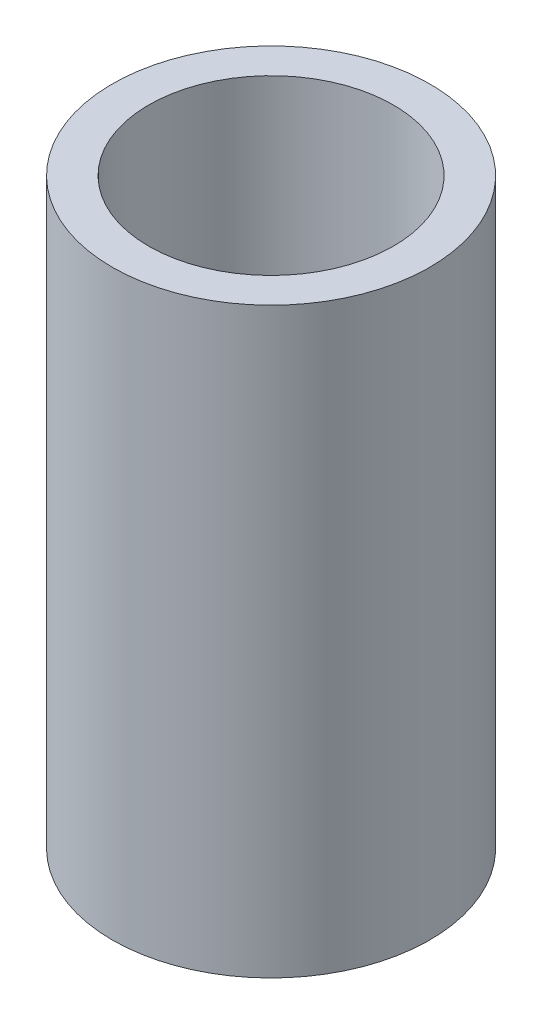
ISO-10303-21;
HEADER;
FILE_DESCRIPTION(('STEP AP214'),'2;1');
FILE_NAME('part.step','',(''),(''),'','','');
FILE_SCHEMA(('AUTOMOTIVE_DESIGN { 1 0 10303 214 1 1 1 1 }'));
ENDSEC;
DATA;
#1=APPLICATION_CONTEXT('core data for automotive mechanical design processes');
#2=APPLICATION_PROTOCOL_DEFINITION('international standard','automotive_design',2000,#1);
#3=PRODUCT_CONTEXT('',#1,'mechanical');
#4=PRODUCT('Part','Part','',(#3));
#5=PRODUCT_RELATED_PRODUCT_CATEGORY('part','',(#4));
#6=PRODUCT_DEFINITION_FORMATION('','',#4);
#7=PRODUCT_DEFINITION_CONTEXT('part definition',#1,'design');
#8=PRODUCT_DEFINITION('design','',#6,#7);
#9=PRODUCT_DEFINITION_SHAPE('','',#8);
#10=(LENGTH_UNIT() NAMED_UNIT(*) SI_UNIT(.MILLI.,.METRE.));
#11=(NAMED_UNIT(*) PLANE_ANGLE_UNIT() SI_UNIT($,.RADIAN.));
#12=(NAMED_UNIT(*) SI_UNIT($,.STERADIAN.) SOLID_ANGLE_UNIT());
#13=UNCERTAINTY_MEASURE_WITH_UNIT(LENGTH_MEASURE(1.E-05),#10,'distance_accuracy_value','');
#14=(GEOMETRIC_REPRESENTATION_CONTEXT(3) GLOBAL_UNCERTAINTY_ASSIGNED_CONTEXT((#13)) GLOBAL_UNIT_ASSIGNED_CONTEXT((#10,
#11,#12)) REPRESENTATION_CONTEXT('',''));
#15=CARTESIAN_POINT('',(0.,0.,0.));
#16=DIRECTION('',(0.,0.,1.));
#17=DIRECTION('',(1.,0.,0.));
#18=AXIS2_PLACEMENT_3D('',#15,#16,#17);
#19=CARTESIAN_POINT('',(0.,80.,0.));
#20=DIRECTION('',(0.,1.,0.));
#21=DIRECTION('',(0.,0.,1.));
#22=AXIS2_PLACEMENT_3D('',#19,#20,#21);
#23=PLANE('',#22);
#24=CARTESIAN_POINT('',(0.,80.,0.));
#25=DIRECTION('',(0.,1.,0.));
#26=DIRECTION('',(0.,0.,1.));
#27=AXIS2_PLACEMENT_3D('',#24,#25,#26);
#28=CIRCLE('',#27,21.8);
#29=CARTESIAN_POINT('',(0.,80.,21.8));
#30=VERTEX_POINT('',#29);
#31=EDGE_CURVE('E10',#30,#30,#28,.T.);
#32=ORIENTED_EDGE('',*,*,#31,.T.);
#33=EDGE_LOOP('',(#32));
#34=FACE_BOUND('',#33,.T.);
#35=CARTESIAN_POINT('',(0.,80.,0.));
#36=DIRECTION('',(0.,1.,0.));
#37=DIRECTION('',(0.,0.,1.));
#38=AXIS2_PLACEMENT_3D('',#35,#36,#37);
#39=CIRCLE('',#38,16.8);
#40=CARTESIAN_POINT('',(0.,80.,16.8));
#41=VERTEX_POINT('',#40);
#42=EDGE_CURVE('E46',#41,#41,#39,.T.);
#43=ORIENTED_EDGE('',*,*,#42,.F.);
#44=EDGE_LOOP('',(#43));
#45=FACE_BOUND('',#44,.T.);
#46=ADVANCED_FACE('F35',(#34,#45),#23,.T.);
#47=CARTESIAN_POINT('',(0.,0.,0.));
#48=DIRECTION('',(0.,1.,0.));
#49=DIRECTION('',(0.,0.,1.));
#50=AXIS2_PLACEMENT_3D('',#47,#48,#49);
#51=PLANE('',#50);
#52=CARTESIAN_POINT('',(0.,0.,0.));
#53=DIRECTION('',(0.,1.,0.));
#54=DIRECTION('',(0.,0.,1.));
#55=AXIS2_PLACEMENT_3D('',#52,#53,#54);
#56=CIRCLE('',#55,21.8);
#57=CARTESIAN_POINT('',(0.,0.,21.8));
#58=VERTEX_POINT('',#57);
#59=EDGE_CURVE('E39',#58,#58,#56,.T.);
#60=ORIENTED_EDGE('',*,*,#59,.F.);
#61=EDGE_LOOP('',(#60));
#62=FACE_BOUND('',#61,.T.);
#63=CARTESIAN_POINT('',(0.,0.,0.));
#64=DIRECTION('',(0.,1.,0.));
#65=DIRECTION('',(0.,0.,1.));
#66=AXIS2_PLACEMENT_3D('',#63,#64,#65);
#67=CIRCLE('',#66,16.8);
#68=CARTESIAN_POINT('',(0.,0.,16.8));
#69=VERTEX_POINT('',#68);
#70=EDGE_CURVE('E48',#69,#69,#67,.T.);
#71=ORIENTED_EDGE('',*,*,#70,.T.);
#72=EDGE_LOOP('',(#71));
#73=FACE_BOUND('',#72,.T.);
#74=ADVANCED_FACE('F58',(#62,#73),#51,.F.);
#75=CARTESIAN_POINT('',(0.,80.,0.));
#76=DIRECTION('',(0.,-1.,0.));
#77=DIRECTION('',(0.,0.,-1.));
#78=AXIS2_PLACEMENT_3D('',#75,#76,#77);
#79=CYLINDRICAL_SURFACE('',#78,21.8);
#80=ORIENTED_EDGE('',*,*,#31,.F.);
#81=EDGE_LOOP('',(#80));
#82=FACE_BOUND('',#81,.T.);
#83=ORIENTED_EDGE('',*,*,#59,.T.);
#84=EDGE_LOOP('',(#83));
#85=FACE_BOUND('',#84,.T.);
#86=ADVANCED_FACE('F37',(#82,#85),#79,.T.);
#87=CARTESIAN_POINT('',(0.,80.,0.));
#88=DIRECTION('',(0.,-1.,0.));
#89=DIRECTION('',(0.,0.,-1.));
#90=AXIS2_PLACEMENT_3D('',#87,#88,#89);
#91=CYLINDRICAL_SURFACE('',#90,16.8);
#92=ORIENTED_EDGE('',*,*,#42,.T.);
#93=EDGE_LOOP('',(#92));
#94=FACE_BOUND('',#93,.T.);
#95=ORIENTED_EDGE('',*,*,#70,.F.);
#96=EDGE_LOOP('',(#95));
#97=FACE_BOUND('',#96,.T.);
#98=ADVANCED_FACE('F54',(#94,#97),#91,.F.);
#99=CLOSED_SHELL('',(#46,#74,#86,#98));
#100=MANIFOLD_SOLID_BREP('B2',#99);
#101=ADVANCED_BREP_SHAPE_REPRESENTATION('',(#18,#100),#14);
#102=SHAPE_DEFINITION_REPRESENTATION(#9,#101);
ENDSEC;
END-ISO-10303-21;
